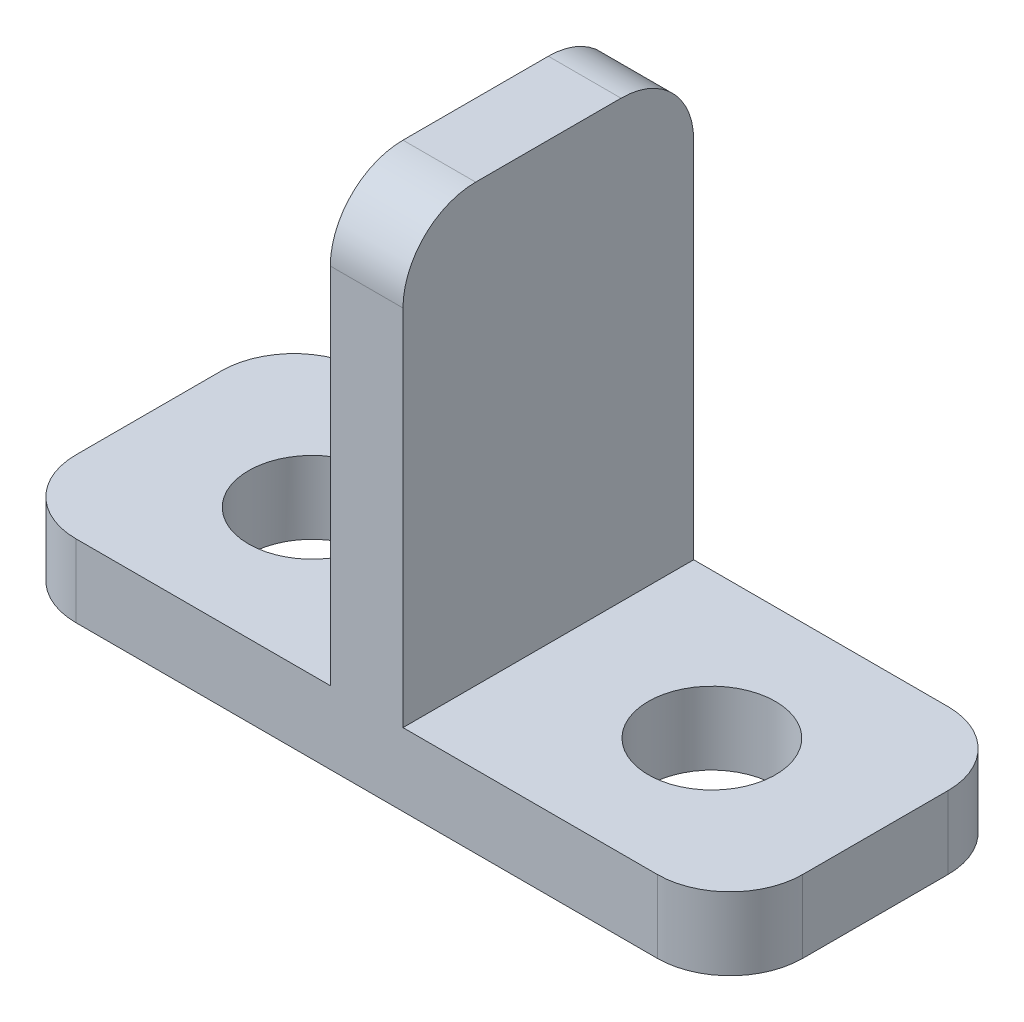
from build123d import *

# Parameters (mm, degrees)
SKETCH_1_W          = 20
SKETCH_1_H          = 8
EXTRUDE_1_DEPTH     = 2
SKETCH_2_W          = 2
SKETCH_2_H          = 8
EXTRUDE_2_DEPTH     = 12
SKETCH_3_R          = 1.75
CUT_EXTRUDE_1_DEPTH = 10
FILLET_1_R          = 2


with BuildPart() as part:
    # Sketch 1 → Extrude 1 (new body)
    with BuildSketch(Plane(origin=(0, 0, 0), x_dir=(1, 0, 0), z_dir=(0, 1, 0))):
        Rectangle(SKETCH_1_W, SKETCH_1_H)
    extrude(amount=EXTRUDE_1_DEPTH)

    # Sketch 2 → Extrude 2 (add)
    with BuildSketch(Plane(origin=(0, 2, 0), x_dir=(1, 0, 0), z_dir=(0, 1, 0))):
        Rectangle(SKETCH_2_W, SKETCH_2_H)
    extrude(amount=EXTRUDE_2_DEPTH)

    # Sketch 3 → Cut-Extrude 1 (cut)
    with BuildSketch(Plane(origin=(0, 2, 0), x_dir=(1, 0, 0), z_dir=(0, 1, 0))):
        with Locations(Location((-5.5, 0, 0), (0, 0, 270))):
            Circle(SKETCH_3_R)
        with Locations(Location((5.5, 0, 0), (0, 0, 90))):
            Circle(SKETCH_3_R)
    extrude(amount=-CUT_EXTRUDE_1_DEPTH, mode=Mode.SUBTRACT)

    # Fillet 1
    fillet_1_edges = [part.edges().sort_by_distance(p)[0] for p in [
        (0, 14, -4),
        (0, 14, 4),
        (10, 1, 4),
        (-10, 1, 4),
        (-10, 1, -4),
        (10, 1, -4),
    ]]
    fillet(fillet_1_edges, radius=FILLET_1_R)


solid = part.part
